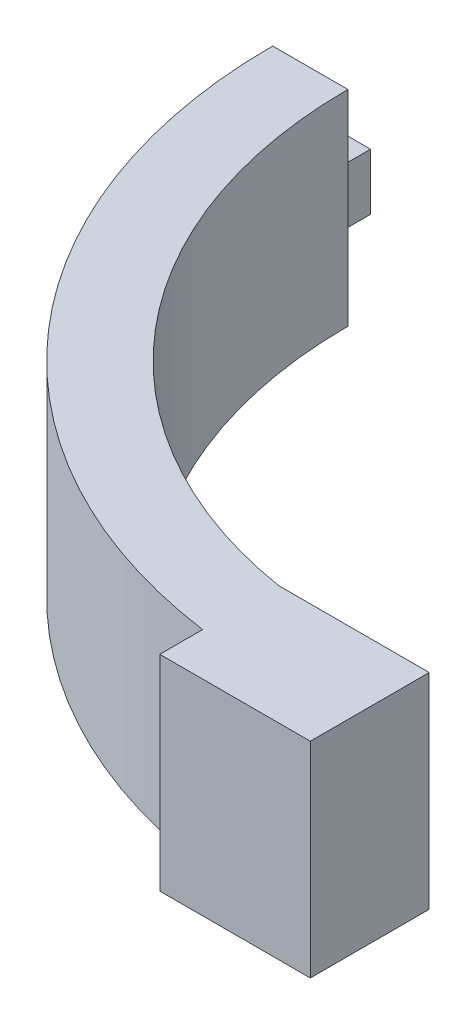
ISO-10303-21;
HEADER;
FILE_DESCRIPTION(('STEP AP214'),'2;1');
FILE_NAME('part.step','',(''),(''),'','','');
FILE_SCHEMA(('AUTOMOTIVE_DESIGN { 1 0 10303 214 1 1 1 1 }'));
ENDSEC;
DATA;
#1=APPLICATION_CONTEXT('core data for automotive mechanical design processes');
#2=APPLICATION_PROTOCOL_DEFINITION('international standard','automotive_design',2000,#1);
#3=PRODUCT_CONTEXT('',#1,'mechanical');
#4=PRODUCT('Part','Part','',(#3));
#5=PRODUCT_RELATED_PRODUCT_CATEGORY('part','',(#4));
#6=PRODUCT_DEFINITION_FORMATION('','',#4);
#7=PRODUCT_DEFINITION_CONTEXT('part definition',#1,'design');
#8=PRODUCT_DEFINITION('design','',#6,#7);
#9=PRODUCT_DEFINITION_SHAPE('','',#8);
#10=(LENGTH_UNIT() NAMED_UNIT(*) SI_UNIT(.MILLI.,.METRE.));
#11=(NAMED_UNIT(*) PLANE_ANGLE_UNIT() SI_UNIT($,.RADIAN.));
#12=(NAMED_UNIT(*) SI_UNIT($,.STERADIAN.) SOLID_ANGLE_UNIT());
#13=UNCERTAINTY_MEASURE_WITH_UNIT(LENGTH_MEASURE(1.E-05),#10,'distance_accuracy_value','');
#14=(GEOMETRIC_REPRESENTATION_CONTEXT(3) GLOBAL_UNCERTAINTY_ASSIGNED_CONTEXT((#13)) GLOBAL_UNIT_ASSIGNED_CONTEXT((#10,
#11,#12)) REPRESENTATION_CONTEXT('',''));
#15=CARTESIAN_POINT('',(0.,0.,0.));
#16=DIRECTION('',(0.,0.,1.));
#17=DIRECTION('',(1.,0.,0.));
#18=AXIS2_PLACEMENT_3D('',#15,#16,#17);
#19=CARTESIAN_POINT('',(-145.,0.,-125.));
#20=DIRECTION('',(0.,0.,1.));
#21=DIRECTION('',(1.,0.,0.));
#22=AXIS2_PLACEMENT_3D('',#19,#20,#21);
#23=PLANE('',#22);
#24=DIRECTION('',(1.,0.,0.));
#25=VECTOR('',#24,1.);
#26=CARTESIAN_POINT('',(-145.,0.,-125.));
#27=LINE('',#26,#25);
#28=CARTESIAN_POINT('',(-145.,0.,-125.));
#29=VERTEX_POINT('',#28);
#30=CARTESIAN_POINT('',(-125.,0.,-125.));
#31=VERTEX_POINT('',#30);
#32=EDGE_CURVE('E147',#29,#31,#27,.T.);
#33=ORIENTED_EDGE('',*,*,#32,.F.);
#34=DIRECTION('',(0.,1.,0.));
#35=VECTOR('',#34,1.);
#36=CARTESIAN_POINT('',(-145.,0.,-125.));
#37=LINE('',#36,#35);
#38=CARTESIAN_POINT('',(-145.,54.500003,-125.));
#39=VERTEX_POINT('',#38);
#40=EDGE_CURVE('E181',#29,#39,#37,.T.);
#41=ORIENTED_EDGE('',*,*,#40,.T.);
#42=DIRECTION('',(1.,0.,0.));
#43=VECTOR('',#42,1.);
#44=CARTESIAN_POINT('',(0.,54.5,-125.));
#45=LINE('',#44,#43);
#46=CARTESIAN_POINT('',(-125.,54.5,-125.));
#47=VERTEX_POINT('',#46);
#48=EDGE_CURVE('E184',#39,#47,#45,.T.);
#49=ORIENTED_EDGE('',*,*,#48,.T.);
#50=DIRECTION('',(0.,-1.,0.));
#51=VECTOR('',#50,1.);
#52=CARTESIAN_POINT('',(-125.,54.5,-125.));
#53=LINE('',#52,#51);
#54=EDGE_CURVE('E69',#31,#47,#53,.F.);
#55=ORIENTED_EDGE('',*,*,#54,.F.);
#56=EDGE_LOOP('',(#33,#41,#49,#55));
#57=FACE_BOUND('',#56,.T.);
#58=DIRECTION('',(0.,1.,0.));
#59=VECTOR('',#58,1.);
#60=CARTESIAN_POINT('',(-142.,0.,-125.));
#61=LINE('',#60,#59);
#62=CARTESIAN_POINT('',(-142.,19.7500015,-125.));
#63=VERTEX_POINT('',#62);
#64=CARTESIAN_POINT('',(-142.,34.7500015,-125.));
#65=VERTEX_POINT('',#64);
#66=EDGE_CURVE('E61',#63,#65,#61,.T.);
#67=ORIENTED_EDGE('',*,*,#66,.F.);
#68=DIRECTION('',(-1.,0.,0.));
#69=VECTOR('',#68,1.);
#70=CARTESIAN_POINT('',(0.,19.7500015,-125.));
#71=LINE('',#70,#69);
#72=CARTESIAN_POINT('',(-128.,19.7500015,-125.));
#73=VERTEX_POINT('',#72);
#74=EDGE_CURVE('E139',#73,#63,#71,.T.);
#75=ORIENTED_EDGE('',*,*,#74,.F.);
#76=DIRECTION('',(0.,-1.,0.));
#77=VECTOR('',#76,1.);
#78=CARTESIAN_POINT('',(-128.,0.,-125.));
#79=LINE('',#78,#77);
#80=CARTESIAN_POINT('',(-128.,34.7500015,-125.));
#81=VERTEX_POINT('',#80);
#82=EDGE_CURVE('E166',#81,#73,#79,.T.);
#83=ORIENTED_EDGE('',*,*,#82,.F.);
#84=DIRECTION('',(-1.,0.,0.));
#85=VECTOR('',#84,1.);
#86=CARTESIAN_POINT('',(0.,34.7500015,-125.));
#87=LINE('',#86,#85);
#88=EDGE_CURVE('E163',#81,#65,#87,.T.);
#89=ORIENTED_EDGE('',*,*,#88,.T.);
#90=EDGE_LOOP('',(#67,#75,#83,#89));
#91=FACE_BOUND('',#90,.T.);
#92=ADVANCED_FACE('F43',(#57,#91),#23,.F.);
#93=CARTESIAN_POINT('',(0.,54.5,-125.));
#94=DIRECTION('',(0.,-1.,0.));
#95=DIRECTION('',(0.,0.,-1.));
#96=AXIS2_PLACEMENT_3D('',#93,#94,#95);
#97=CYLINDRICAL_SURFACE('',#96,145.);
#98=CARTESIAN_POINT('',(0.,54.5,-125.));
#99=DIRECTION('',(0.,1.,0.));
#100=DIRECTION('',(0.,0.,1.));
#101=AXIS2_PLACEMENT_3D('',#98,#99,#100);
#102=CIRCLE('',#101,145.);
#103=CARTESIAN_POINT('',(-20.,54.5,18.6140661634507));
#104=VERTEX_POINT('',#103);
#105=EDGE_CURVE('E47',#39,#104,#102,.T.);
#106=ORIENTED_EDGE('',*,*,#105,.F.);
#107=ORIENTED_EDGE('',*,*,#40,.F.);
#108=CARTESIAN_POINT('',(0.,0.,-125.));
#109=DIRECTION('',(0.,1.,0.));
#110=DIRECTION('',(0.,0.,1.));
#111=AXIS2_PLACEMENT_3D('',#108,#109,#110);
#112=CIRCLE('',#111,145.);
#113=CARTESIAN_POINT('',(-20.,0.,18.6140661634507));
#114=VERTEX_POINT('',#113);
#115=EDGE_CURVE('E192',#29,#114,#112,.T.);
#116=ORIENTED_EDGE('',*,*,#115,.T.);
#117=DIRECTION('',(0.,-1.,0.));
#118=VECTOR('',#117,1.);
#119=CARTESIAN_POINT('',(-20.,54.5,18.6140661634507));
#120=LINE('',#119,#118);
#121=EDGE_CURVE('E11',#104,#114,#120,.T.);
#122=ORIENTED_EDGE('',*,*,#121,.F.);
#123=EDGE_LOOP('',(#106,#107,#116,#122));
#124=FACE_BOUND('',#123,.T.);
#125=ADVANCED_FACE('F45',(#124),#97,.T.);
#126=CARTESIAN_POINT('',(-20.,54.5,18.6140661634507));
#127=DIRECTION('',(1.,0.,0.));
#128=DIRECTION('',(0.,0.,-1.));
#129=AXIS2_PLACEMENT_3D('',#126,#127,#128);
#130=PLANE('',#129);
#131=DIRECTION('',(0.,0.,1.));
#132=VECTOR('',#131,1.);
#133=CARTESIAN_POINT('',(-20.,0.,18.6140661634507));
#134=LINE('',#133,#132);
#135=CARTESIAN_POINT('',(-20.,0.,30.));
#136=VERTEX_POINT('',#135);
#137=EDGE_CURVE('E214',#114,#136,#134,.T.);
#138=ORIENTED_EDGE('',*,*,#137,.T.);
#139=DIRECTION('',(0.,-1.,0.));
#140=VECTOR('',#139,1.);
#141=CARTESIAN_POINT('',(-20.,54.5,30.));
#142=LINE('',#141,#140);
#143=CARTESIAN_POINT('',(-20.,54.5,30.));
#144=VERTEX_POINT('',#143);
#145=EDGE_CURVE('E54',#144,#136,#142,.T.);
#146=ORIENTED_EDGE('',*,*,#145,.F.);
#147=DIRECTION('',(0.,0.,1.));
#148=VECTOR('',#147,1.);
#149=CARTESIAN_POINT('',(-20.,54.5,18.6140661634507));
#150=LINE('',#149,#148);
#151=EDGE_CURVE('E195',#104,#144,#150,.T.);
#152=ORIENTED_EDGE('',*,*,#151,.F.);
#153=ORIENTED_EDGE('',*,*,#121,.T.);
#154=EDGE_LOOP('',(#138,#146,#152,#153));
#155=FACE_BOUND('',#154,.T.);
#156=ADVANCED_FACE('F272',(#155),#130,.F.);
#157=CARTESIAN_POINT('',(20.,54.5,30.));
#158=DIRECTION('',(0.,0.,-1.));
#159=DIRECTION('',(-1.,0.,0.));
#160=AXIS2_PLACEMENT_3D('',#157,#158,#159);
#161=PLANE('',#160);
#162=DIRECTION('',(1.,0.,0.));
#163=VECTOR('',#162,1.);
#164=CARTESIAN_POINT('',(20.,0.,30.));
#165=LINE('',#164,#163);
#166=CARTESIAN_POINT('',(20.,0.,30.));
#167=VERTEX_POINT('',#166);
#168=EDGE_CURVE('E217',#136,#167,#165,.T.);
#169=ORIENTED_EDGE('',*,*,#168,.T.);
#170=DIRECTION('',(0.,-1.,0.));
#171=VECTOR('',#170,1.);
#172=CARTESIAN_POINT('',(20.,54.5,30.));
#173=LINE('',#172,#171);
#174=CARTESIAN_POINT('',(20.,54.5,30.));
#175=VERTEX_POINT('',#174);
#176=EDGE_CURVE('E238',#175,#167,#173,.T.);
#177=ORIENTED_EDGE('',*,*,#176,.F.);
#178=DIRECTION('',(1.,0.,0.));
#179=VECTOR('',#178,1.);
#180=CARTESIAN_POINT('',(20.,54.5,30.));
#181=LINE('',#180,#179);
#182=EDGE_CURVE('E198',#144,#175,#181,.T.);
#183=ORIENTED_EDGE('',*,*,#182,.F.);
#184=ORIENTED_EDGE('',*,*,#145,.T.);
#185=EDGE_LOOP('',(#169,#177,#183,#184));
#186=FACE_BOUND('',#185,.T.);
#187=ADVANCED_FACE('F248',(#186),#161,.F.);
#188=CARTESIAN_POINT('',(20.,54.5,-1.61037320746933));
#189=DIRECTION('',(-1.,0.,0.));
#190=DIRECTION('',(0.,0.,1.));
#191=AXIS2_PLACEMENT_3D('',#188,#189,#190);
#192=PLANE('',#191);
#193=DIRECTION('',(0.,0.,-1.));
#194=VECTOR('',#193,1.);
#195=CARTESIAN_POINT('',(20.,0.,-1.61037320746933));
#196=LINE('',#195,#194);
#197=CARTESIAN_POINT('',(20.,0.,-1.61037320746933));
#198=VERTEX_POINT('',#197);
#199=EDGE_CURVE('E221',#167,#198,#196,.T.);
#200=ORIENTED_EDGE('',*,*,#199,.T.);
#201=DIRECTION('',(0.,-1.,0.));
#202=VECTOR('',#201,1.);
#203=CARTESIAN_POINT('',(20.,54.5,-1.61037320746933));
#204=LINE('',#203,#202);
#205=CARTESIAN_POINT('',(20.,54.5,-1.61037320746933));
#206=VERTEX_POINT('',#205);
#207=EDGE_CURVE('E234',#206,#198,#204,.T.);
#208=ORIENTED_EDGE('',*,*,#207,.F.);
#209=DIRECTION('',(0.,0.,-1.));
#210=VECTOR('',#209,1.);
#211=CARTESIAN_POINT('',(20.,54.5,0.));
#212=LINE('',#211,#210);
#213=EDGE_CURVE('E201',#175,#206,#212,.T.);
#214=ORIENTED_EDGE('',*,*,#213,.F.);
#215=ORIENTED_EDGE('',*,*,#176,.T.);
#216=EDGE_LOOP('',(#200,#208,#214,#215));
#217=FACE_BOUND('',#216,.T.);
#218=ADVANCED_FACE('F260',(#217),#192,.F.);
#219=CARTESIAN_POINT('',(-20.,54.5,-1.61037320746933));
#220=DIRECTION('',(0.,0.,1.));
#221=DIRECTION('',(1.,0.,0.));
#222=AXIS2_PLACEMENT_3D('',#219,#220,#221);
#223=PLANE('',#222);
#224=DIRECTION('',(-1.,0.,0.));
#225=VECTOR('',#224,1.);
#226=CARTESIAN_POINT('',(-20.,0.,-1.61037320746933));
#227=LINE('',#226,#225);
#228=CARTESIAN_POINT('',(-20.0000000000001,0.,-1.61037320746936));
#229=VERTEX_POINT('',#228);
#230=EDGE_CURVE('E224',#198,#229,#227,.T.);
#231=ORIENTED_EDGE('',*,*,#230,.T.);
#232=DIRECTION('',(0.,-1.,0.));
#233=VECTOR('',#232,1.);
#234=CARTESIAN_POINT('',(-20.0000000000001,54.5,-1.61037320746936));
#235=LINE('',#234,#233);
#236=CARTESIAN_POINT('',(-20.0000000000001,54.5,-1.61037320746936));
#237=VERTEX_POINT('',#236);
#238=EDGE_CURVE('E211',#237,#229,#235,.T.);
#239=ORIENTED_EDGE('',*,*,#238,.F.);
#240=DIRECTION('',(-1.,0.,0.));
#241=VECTOR('',#240,1.);
#242=CARTESIAN_POINT('',(-20.,54.5,-1.61037320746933));
#243=LINE('',#242,#241);
#244=EDGE_CURVE('E204',#206,#237,#243,.T.);
#245=ORIENTED_EDGE('',*,*,#244,.F.);
#246=ORIENTED_EDGE('',*,*,#207,.T.);
#247=EDGE_LOOP('',(#231,#239,#245,#246));
#248=FACE_BOUND('',#247,.T.);
#249=ADVANCED_FACE('F264',(#248),#223,.F.);
#250=CARTESIAN_POINT('',(0.,54.5,-125.));
#251=DIRECTION('',(0.,-1.,0.));
#252=DIRECTION('',(0.,0.,-1.));
#253=AXIS2_PLACEMENT_3D('',#250,#251,#252);
#254=CYLINDRICAL_SURFACE('',#253,125.);
#255=CARTESIAN_POINT('',(0.,0.,-125.));
#256=DIRECTION('',(0.,-1.,0.));
#257=DIRECTION('',(0.,0.,1.));
#258=AXIS2_PLACEMENT_3D('',#255,#256,#257);
#259=CIRCLE('',#258,125.);
#260=EDGE_CURVE('E227',#229,#31,#259,.T.);
#261=ORIENTED_EDGE('',*,*,#260,.T.);
#262=ORIENTED_EDGE('',*,*,#54,.T.);
#263=CARTESIAN_POINT('',(0.,54.5,-125.));
#264=DIRECTION('',(0.,-1.,0.));
#265=DIRECTION('',(0.,0.,1.));
#266=AXIS2_PLACEMENT_3D('',#263,#264,#265);
#267=CIRCLE('',#266,125.);
#268=EDGE_CURVE('E207',#237,#47,#267,.T.);
#269=ORIENTED_EDGE('',*,*,#268,.F.);
#270=ORIENTED_EDGE('',*,*,#238,.T.);
#271=EDGE_LOOP('',(#261,#262,#269,#270));
#272=FACE_BOUND('',#271,.T.);
#273=ADVANCED_FACE('F276',(#272),#254,.F.);
#274=CARTESIAN_POINT('',(0.,54.5,-125.));
#275=DIRECTION('',(0.,1.,0.));
#276=DIRECTION('',(0.,0.,1.));
#277=AXIS2_PLACEMENT_3D('',#274,#275,#276);
#278=PLANE('',#277);
#279=ORIENTED_EDGE('',*,*,#48,.F.);
#280=ORIENTED_EDGE('',*,*,#105,.T.);
#281=ORIENTED_EDGE('',*,*,#151,.T.);
#282=ORIENTED_EDGE('',*,*,#182,.T.);
#283=ORIENTED_EDGE('',*,*,#213,.T.);
#284=ORIENTED_EDGE('',*,*,#244,.T.);
#285=ORIENTED_EDGE('',*,*,#268,.T.);
#286=EDGE_LOOP('',(#279,#280,#281,#282,#283,#284,#285));
#287=FACE_BOUND('',#286,.T.);
#288=ADVANCED_FACE('F269',(#287),#278,.T.);
#289=CARTESIAN_POINT('',(0.,0.,-125.));
#290=DIRECTION('',(0.,1.,0.));
#291=DIRECTION('',(0.,0.,1.));
#292=AXIS2_PLACEMENT_3D('',#289,#290,#291);
#293=PLANE('',#292);
#294=ORIENTED_EDGE('',*,*,#115,.F.);
#295=ORIENTED_EDGE('',*,*,#32,.T.);
#296=ORIENTED_EDGE('',*,*,#260,.F.);
#297=ORIENTED_EDGE('',*,*,#230,.F.);
#298=ORIENTED_EDGE('',*,*,#199,.F.);
#299=ORIENTED_EDGE('',*,*,#168,.F.);
#300=ORIENTED_EDGE('',*,*,#137,.F.);
#301=EDGE_LOOP('',(#294,#295,#296,#297,#298,#299,#300));
#302=FACE_BOUND('',#301,.T.);
#303=ADVANCED_FACE('F255',(#302),#293,.F.);
#304=CARTESIAN_POINT('',(-142.,0.,-134.));
#305=DIRECTION('',(1.,0.,0.));
#306=DIRECTION('',(0.,0.,-1.));
#307=AXIS2_PLACEMENT_3D('',#304,#305,#306);
#308=PLANE('',#307);
#309=ORIENTED_EDGE('',*,*,#66,.T.);
#310=DIRECTION('',(0.,0.,1.));
#311=VECTOR('',#310,1.);
#312=CARTESIAN_POINT('',(-142.,34.7500015,-134.));
#313=LINE('',#312,#311);
#314=CARTESIAN_POINT('',(-142.,34.7500015,-134.));
#315=VERTEX_POINT('',#314);
#316=EDGE_CURVE('E141',#315,#65,#313,.T.);
#317=ORIENTED_EDGE('',*,*,#316,.F.);
#318=DIRECTION('',(0.,1.,0.));
#319=VECTOR('',#318,1.);
#320=CARTESIAN_POINT('',(-142.,0.,-134.));
#321=LINE('',#320,#319);
#322=CARTESIAN_POINT('',(-142.,19.7500015,-134.));
#323=VERTEX_POINT('',#322);
#324=EDGE_CURVE('E131',#323,#315,#321,.T.);
#325=ORIENTED_EDGE('',*,*,#324,.F.);
#326=DIRECTION('',(0.,0.,1.));
#327=VECTOR('',#326,1.);
#328=CARTESIAN_POINT('',(-142.,19.7500015,-134.));
#329=LINE('',#328,#327);
#330=EDGE_CURVE('E160',#323,#63,#329,.T.);
#331=ORIENTED_EDGE('',*,*,#330,.T.);
#332=EDGE_LOOP('',(#309,#317,#325,#331));
#333=FACE_BOUND('',#332,.T.);
#334=ADVANCED_FACE('F142',(#333),#308,.F.);
#335=CARTESIAN_POINT('',(0.,34.7500015,-134.));
#336=DIRECTION('',(0.,1.,0.));
#337=DIRECTION('',(0.,0.,1.));
#338=AXIS2_PLACEMENT_3D('',#335,#336,#337);
#339=PLANE('',#338);
#340=ORIENTED_EDGE('',*,*,#88,.F.);
#341=DIRECTION('',(0.,0.,1.));
#342=VECTOR('',#341,1.);
#343=CARTESIAN_POINT('',(-128.,34.7500015,-134.));
#344=LINE('',#343,#342);
#345=CARTESIAN_POINT('',(-128.,34.7500015,-134.));
#346=VERTEX_POINT('',#345);
#347=EDGE_CURVE('E148',#346,#81,#344,.T.);
#348=ORIENTED_EDGE('',*,*,#347,.F.);
#349=DIRECTION('',(-1.,0.,0.));
#350=VECTOR('',#349,1.);
#351=CARTESIAN_POINT('',(0.,34.7500015,-134.));
#352=LINE('',#351,#350);
#353=EDGE_CURVE('E134',#346,#315,#352,.T.);
#354=ORIENTED_EDGE('',*,*,#353,.T.);
#355=ORIENTED_EDGE('',*,*,#316,.T.);
#356=EDGE_LOOP('',(#340,#348,#354,#355));
#357=FACE_BOUND('',#356,.T.);
#358=ADVANCED_FACE('F150',(#357),#339,.T.);
#359=CARTESIAN_POINT('',(-128.,0.,-134.));
#360=DIRECTION('',(-1.,0.,0.));
#361=DIRECTION('',(0.,0.,1.));
#362=AXIS2_PLACEMENT_3D('',#359,#360,#361);
#363=PLANE('',#362);
#364=ORIENTED_EDGE('',*,*,#82,.T.);
#365=DIRECTION('',(0.,0.,1.));
#366=VECTOR('',#365,1.);
#367=CARTESIAN_POINT('',(-128.,19.7500015,-134.));
#368=LINE('',#367,#366);
#369=CARTESIAN_POINT('',(-128.,19.7500015,-134.));
#370=VERTEX_POINT('',#369);
#371=EDGE_CURVE('E173',#370,#73,#368,.T.);
#372=ORIENTED_EDGE('',*,*,#371,.F.);
#373=DIRECTION('',(0.,-1.,0.));
#374=VECTOR('',#373,1.);
#375=CARTESIAN_POINT('',(-128.,0.,-134.));
#376=LINE('',#375,#374);
#377=EDGE_CURVE('E153',#346,#370,#376,.T.);
#378=ORIENTED_EDGE('',*,*,#377,.F.);
#379=ORIENTED_EDGE('',*,*,#347,.T.);
#380=EDGE_LOOP('',(#364,#372,#378,#379));
#381=FACE_BOUND('',#380,.T.);
#382=ADVANCED_FACE('F301',(#381),#363,.F.);
#383=CARTESIAN_POINT('',(0.,19.7500015,-134.));
#384=DIRECTION('',(0.,1.,0.));
#385=DIRECTION('',(0.,0.,1.));
#386=AXIS2_PLACEMENT_3D('',#383,#384,#385);
#387=PLANE('',#386);
#388=ORIENTED_EDGE('',*,*,#74,.T.);
#389=ORIENTED_EDGE('',*,*,#330,.F.);
#390=DIRECTION('',(-1.,0.,0.));
#391=VECTOR('',#390,1.);
#392=CARTESIAN_POINT('',(0.,19.7500015,-134.));
#393=LINE('',#392,#391);
#394=EDGE_CURVE('E136',#370,#323,#393,.T.);
#395=ORIENTED_EDGE('',*,*,#394,.F.);
#396=ORIENTED_EDGE('',*,*,#371,.T.);
#397=EDGE_LOOP('',(#388,#389,#395,#396));
#398=FACE_BOUND('',#397,.T.);
#399=ADVANCED_FACE('F305',(#398),#387,.F.);
#400=CARTESIAN_POINT('',(0.,0.,-134.));
#401=DIRECTION('',(0.,0.,-1.));
#402=DIRECTION('',(-1.,0.,0.));
#403=AXIS2_PLACEMENT_3D('',#400,#401,#402);
#404=PLANE('',#403);
#405=ORIENTED_EDGE('',*,*,#324,.T.);
#406=ORIENTED_EDGE('',*,*,#353,.F.);
#407=ORIENTED_EDGE('',*,*,#377,.T.);
#408=ORIENTED_EDGE('',*,*,#394,.T.);
#409=EDGE_LOOP('',(#405,#406,#407,#408));
#410=FACE_BOUND('',#409,.T.);
#411=ADVANCED_FACE('F132',(#410),#404,.T.);
#412=CLOSED_SHELL('',(#92,#125,#156,#187,#218,#249,#273,#288,#303,#334,#358,#382,#399,#411));
#413=MANIFOLD_SOLID_BREP('B2',#412);
#414=ADVANCED_BREP_SHAPE_REPRESENTATION('',(#18,#413),#14);
#415=SHAPE_DEFINITION_REPRESENTATION(#9,#414);
ENDSEC;
END-ISO-10303-21;
